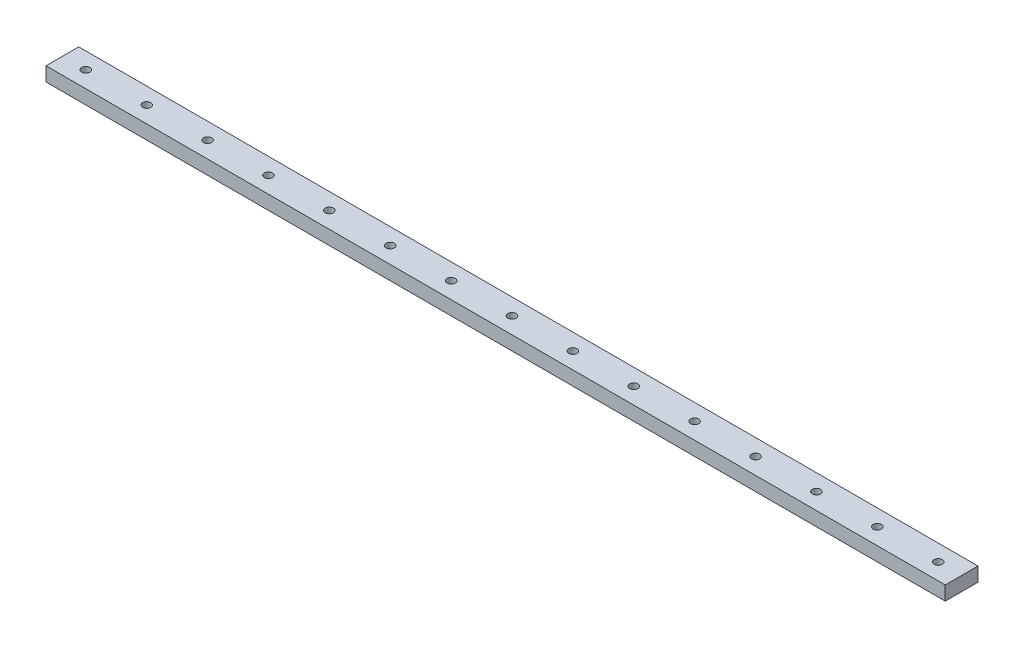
from build123d import *

# Parameters (mm, degrees)
SKETCH1_W           = 2438.4
SKETCH1_H           = 88.9
BOSS_EXTRUDE1_DEPTH = 38.1
SKETCH2_R           = 11.1125
CUT_EXTRUDE1_DEPTH  = 2441.317475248


with BuildPart() as part:
    # Sketch1 → Boss-Extrude1 (new body)
    with BuildSketch(Plane(origin=(0, 0, 0), x_dir=(1, 0, 0), z_dir=(0, 1, 0))):
        with Locations((1219.2, 44.45)):
            Rectangle(SKETCH1_W, SKETCH1_H)
    extrude(amount=BOSS_EXTRUDE1_DEPTH)

    # Sketch2 → Cut-Extrude1 (cut, through all)
    with BuildSketch(Plane(origin=(0, 38.1, 0), x_dir=(1, 0, 0), z_dir=(0, 1, 0))):
        with Locations(Location((63.5, 44.45, 0), (0, 0, 270))):
            Circle(SKETCH2_R)
        with Locations(Location((228.6, 44.45, 0), (0, 0, 270))):
            Circle(SKETCH2_R)
        with Locations(Location((393.7, 44.45, 0), (0, 0, 270))):
            Circle(SKETCH2_R)
        with Locations(Location((558.8, 44.45, 0), (0, 0, 270))):
            Circle(SKETCH2_R)
        with Locations(Location((723.9, 44.45, 0), (0, 0, 270))):
            Circle(SKETCH2_R)
        with Locations(Location((889, 44.45, 0), (0, 0, 270))):
            Circle(SKETCH2_R)
        with Locations(Location((1054.1, 44.45, 0), (0, 0, 270))):
            Circle(SKETCH2_R)
        with Locations(Location((1219.2, 44.45, 0), (0, 0, 270))):
            Circle(SKETCH2_R)
        with Locations(Location((1384.3, 44.45, 0), (0, 0, 270))):
            Circle(SKETCH2_R)
        with Locations(Location((1549.4, 44.45, 0), (0, 0, 270))):
            Circle(SKETCH2_R)
        with Locations(Location((1714.5, 44.45, 0), (0, 0, 270))):
            Circle(SKETCH2_R)
        with Locations(Location((1879.6, 44.45, 0), (0, 0, 270))):
            Circle(SKETCH2_R)
        with Locations(Location((2044.7, 44.45, 0), (0, 0, 270))):
            Circle(SKETCH2_R)
        with Locations(Location((2209.8, 44.45, 0), (0, 0, 270))):
            Circle(SKETCH2_R)
        with Locations(Location((2374.9, 44.45, 0), (0, 0, 270))):
            Circle(SKETCH2_R)
    extrude(amount=-CUT_EXTRUDE1_DEPTH, mode=Mode.SUBTRACT)


solid = part.part
